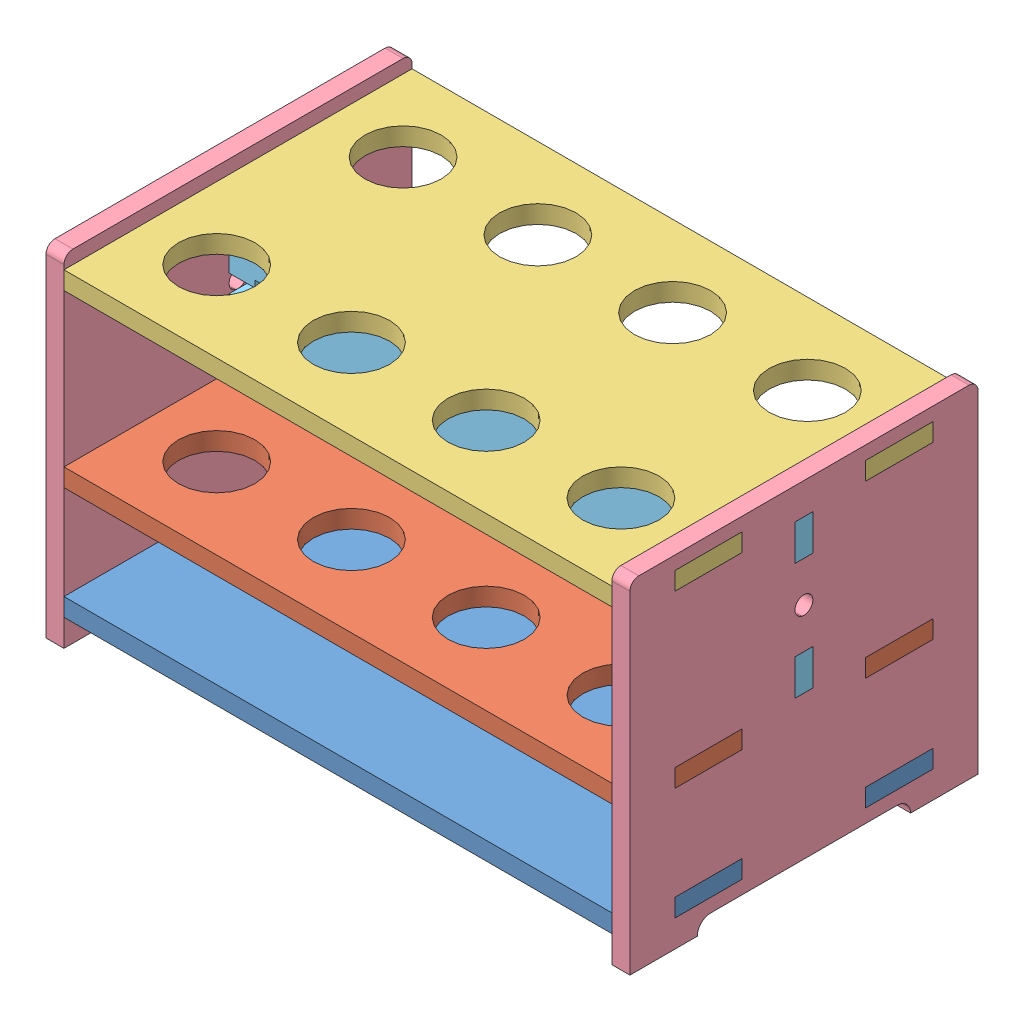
SolidWorks assembly TubeRack8.SLDASM, configuration Standard (file format 6000). Lengths in mm.
Overall size (130 76 77.5).
6 component instances, 5 part files, 15 mates.
Components (placement in the parent):
- BottomPlate-1: BottomPlate.SLDPRT [Standard] at (-3.6064 -1.5807 130) size (130 4 77.5)
- MidPlate-1: MidPlate.SLDPRT [Standard] at (-3.6064 23.4193 130) size (130 4 77.5)
- TopPlate-1: TopPlate.SLDPRT [Standard] at (-3.6064 61.4193 130) size (130 4 77.5)
- SidePlate-1: SidePlate.SLDPRT [Standard] at (-68.6064 30.4193 130) x (0 -1 0) z (0 0 1) size (76 4 77.5)
- SidePlate-2: SidePlate.SLDPRT [Standard] at (57.3936 30.4193 130) x (0 -1 0) z (0 0 1) size (76 4 77.5)
- QuerPlate-1: QuerPlate.SLDPRT [Standard] at (-3.6064 44.4193 132) x (1 0 0) z (0 1 0) size (130 4 34)
Mates (geometry in assembly coordinates):
- Deckungsgleich1: coincident anti-aligned: plane of TopPlate-1 through (-64.6064 65.4193 158.75) normal (-1 0 0); plane of SidePlate-1 through (-64.6064 -7.5807 150.75) normal (1 0 0)
- Deckungsgleich2: coincident anti-aligned: plane of TopPlate-1 through (-64.6064 65.4193 143.75) normal (0 0 -1); plane of SidePlate-1 through (-64.6064 65.4193 143.75) normal (0 0 1)
- Deckungsgleich3: coincident anti-aligned: plane of TopPlate-1 through (-3.6064 61.4193 130) normal (0 -1 0); plane of SidePlate-1 through (-64.6064 61.4193 158.75) normal (0 1 0)
- Deckungsgleich4: coincident anti-aligned: plane of MidPlate-1 through (-3.6064 27.4193 130) normal (0 1 0); plane of SidePlate-1 through (-64.6064 27.4193 101.25) normal (0 -1 0)
- Deckungsgleich5: coincident anti-aligned: plane of MidPlate-1 through (-68.6064 27.4193 158.75) normal (0 0 1); plane of SidePlate-1 through (-64.6064 27.4193 158.75) normal (0 0 -1)
- Deckungsgleich7: coincident anti-aligned: plane of MidPlate-1 through (-64.6064 27.4193 91.25) normal (-1 0 0); plane of SidePlate-1 through (-64.6064 -7.5807 150.75) normal (1 0 0)
- Deckungsgleich8: coincident anti-aligned: plane of BottomPlate-1 through (-64.6064 2.4193 91.25) normal (-1 0 0); plane of SidePlate-1 through (-64.6064 -7.5807 150.75) normal (1 0 0)
- Deckungsgleich9: coincident: plane of BottomPlate-1 through (-3.6064 2.4193 130) normal (0 1 0); line of SidePlate-1 through (-64.6064 2.4193 101.25) axis (0 0 1)
- Deckungsgleich10: coincident anti-aligned: plane of BottomPlate-1 through (-64.6064 2.4193 101.25) normal (0 0 -1); plane of SidePlate-1 through (-64.6064 2.4193 101.25) normal (0 0 1)
- Deckungsgleich11: coincident anti-aligned: plane of TopPlate-1 through (57.3936 65.4193 158.75) normal (1 0 0); plane of SidePlate-2 through (57.3936 -7.5807 150.75) normal (-1 0 0)
- Deckungsgleich12: coincident anti-aligned: plane of TopPlate-1 through (-3.6064 65.4193 130) normal (0 1 0); plane of SidePlate-2 through (61.3936 65.4193 158.75) normal (0 -1 0)
- Deckungsgleich13: coincident anti-aligned: plane of TopPlate-1 through (57.3936 65.4193 143.75) normal (0 0 -1); plane of SidePlate-2 through (61.3936 65.4193 143.75) normal (0 0 1)
- Deckungsgleich15: coincident anti-aligned: plane of SidePlate-1 through (-64.6064 61.4193 128) normal (0 0 1); plane of QuerPlate-1 through (-3.6064 44.4193 128) normal (0 0 -1)
- Deckungsgleich19: coincident anti-aligned: plane of SidePlate-1 through (-64.6064 27.4193 128) normal (0 1 0); plane of QuerPlate-1 through (-68.6064 27.4193 128) normal (0 -1 0)
- Deckungsgleich20: coincident anti-aligned: plane of SidePlate-1 through (-64.6064 -7.5807 150.75) normal (1 0 0); plane of QuerPlate-1 through (-64.6064 35.4193 128) normal (-1 0 0)
